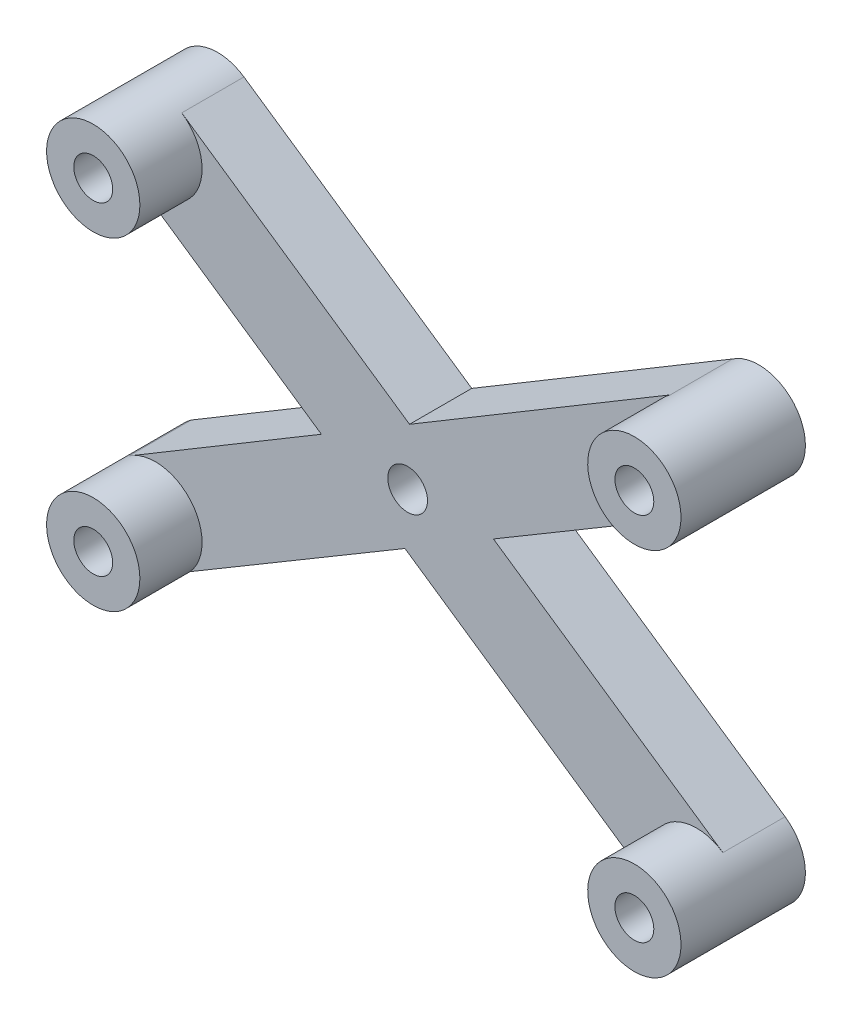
ISO-10303-21;
HEADER;
FILE_DESCRIPTION(('STEP AP214'),'2;1');
FILE_NAME('part.step','',(''),(''),'','','');
FILE_SCHEMA(('AUTOMOTIVE_DESIGN { 1 0 10303 214 1 1 1 1 }'));
ENDSEC;
DATA;
#1=APPLICATION_CONTEXT('core data for automotive mechanical design processes');
#2=APPLICATION_PROTOCOL_DEFINITION('international standard','automotive_design',2000,#1);
#3=PRODUCT_CONTEXT('',#1,'mechanical');
#4=PRODUCT('Part','Part','',(#3));
#5=PRODUCT_RELATED_PRODUCT_CATEGORY('part','',(#4));
#6=PRODUCT_DEFINITION_FORMATION('','',#4);
#7=PRODUCT_DEFINITION_CONTEXT('part definition',#1,'design');
#8=PRODUCT_DEFINITION('design','',#6,#7);
#9=PRODUCT_DEFINITION_SHAPE('','',#8);
#10=(LENGTH_UNIT() NAMED_UNIT(*) SI_UNIT(.MILLI.,.METRE.));
#11=(NAMED_UNIT(*) PLANE_ANGLE_UNIT() SI_UNIT($,.RADIAN.));
#12=(NAMED_UNIT(*) SI_UNIT($,.STERADIAN.) SOLID_ANGLE_UNIT());
#13=UNCERTAINTY_MEASURE_WITH_UNIT(LENGTH_MEASURE(1.E-05),#10,'distance_accuracy_value','');
#14=(GEOMETRIC_REPRESENTATION_CONTEXT(3) GLOBAL_UNCERTAINTY_ASSIGNED_CONTEXT((#13)) GLOBAL_UNIT_ASSIGNED_CONTEXT((#10,
#11,#12)) REPRESENTATION_CONTEXT('',''));
#15=CARTESIAN_POINT('',(0.,0.,0.));
#16=DIRECTION('',(0.,0.,1.));
#17=DIRECTION('',(1.,0.,0.));
#18=AXIS2_PLACEMENT_3D('',#15,#16,#17);
#19=CARTESIAN_POINT('',(21.0892044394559,30.8363157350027,4.));
#20=DIRECTION('',(0.564513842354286,0.825423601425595,0.));
#21=DIRECTION('',(-0.825423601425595,0.564513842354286,0.));
#22=AXIS2_PLACEMENT_3D('',#19,#20,#21);
#23=PLANE('',#22);
#24=DIRECTION('',(0.825423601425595,-0.564513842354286,0.));
#25=VECTOR('',#24,1.);
#26=CARTESIAN_POINT('',(21.0892044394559,30.8363157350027,0.));
#27=LINE('',#26,#25);
#28=CARTESIAN_POINT('',(2.52279479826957,43.5340326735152,0.));
#29=VERTEX_POINT('',#28);
#30=CARTESIAN_POINT('',(17.1727650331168,33.5148001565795,0.));
#31=VERTEX_POINT('',#30);
#32=EDGE_CURVE('E167',#29,#31,#27,.T.);
#33=ORIENTED_EDGE('',*,*,#32,.F.);
#34=DIRECTION('',(0.,0.,-1.));
#35=VECTOR('',#34,1.);
#36=CARTESIAN_POINT('',(2.52279479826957,43.5340326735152,4.));
#37=LINE('',#36,#35);
#38=CARTESIAN_POINT('',(2.52279479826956,43.5340326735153,4.));
#39=VERTEX_POINT('',#38);
#40=EDGE_CURVE('E219',#39,#29,#37,.T.);
#41=ORIENTED_EDGE('',*,*,#40,.F.);
#42=DIRECTION('',(0.825423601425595,-0.564513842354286,0.));
#43=VECTOR('',#42,1.);
#44=CARTESIAN_POINT('',(21.0892044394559,30.8363157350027,4.));
#45=LINE('',#44,#43);
#46=CARTESIAN_POINT('',(17.1727650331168,33.5148001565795,4.));
#47=VERTEX_POINT('',#46);
#48=EDGE_CURVE('E201',#39,#47,#45,.T.);
#49=ORIENTED_EDGE('',*,*,#48,.T.);
#50=DIRECTION('',(0.,0.,-1.));
#51=VECTOR('',#50,1.);
#52=CARTESIAN_POINT('',(17.1727650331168,33.5148001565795,4.));
#53=LINE('',#52,#51);
#54=EDGE_CURVE('E62',#47,#31,#53,.T.);
#55=ORIENTED_EDGE('',*,*,#54,.T.);
#56=EDGE_LOOP('',(#33,#41,#49,#55));
#57=FACE_BOUND('',#56,.T.);
#58=ADVANCED_FACE('F35',(#57),#23,.T.);
#59=CARTESIAN_POINT('',(0.829253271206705,41.0577618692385,4.));
#60=DIRECTION('',(0.,0.,-1.));
#61=DIRECTION('',(-1.,0.,0.));
#62=AXIS2_PLACEMENT_3D('',#59,#60,#61);
#63=CYLINDRICAL_SURFACE('',#62,3.);
#64=CARTESIAN_POINT('',(0.829253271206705,41.0577618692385,0.));
#65=DIRECTION('',(0.,0.,1.));
#66=DIRECTION('',(1.,0.,0.));
#67=AXIS2_PLACEMENT_3D('',#64,#65,#66);
#68=CIRCLE('',#67,3.);
#69=CARTESIAN_POINT('',(-0.864288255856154,38.5814910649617,0.));
#70=VERTEX_POINT('',#69);
#71=EDGE_CURVE('E169',#29,#70,#68,.T.);
#72=ORIENTED_EDGE('',*,*,#71,.T.);
#73=DIRECTION('',(0.,0.,-1.));
#74=VECTOR('',#73,1.);
#75=CARTESIAN_POINT('',(-0.864288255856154,38.5814910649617,4.));
#76=LINE('',#75,#74);
#77=CARTESIAN_POINT('',(-0.864288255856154,38.5814910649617,4.));
#78=VERTEX_POINT('',#77);
#79=EDGE_CURVE('E216',#78,#70,#76,.T.);
#80=ORIENTED_EDGE('',*,*,#79,.F.);
#81=CARTESIAN_POINT('',(0.829253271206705,41.0577618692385,4.));
#82=DIRECTION('',(0.,0.,1.));
#83=DIRECTION('',(1.,0.,0.));
#84=AXIS2_PLACEMENT_3D('',#81,#82,#83);
#85=CIRCLE('',#84,3.);
#86=EDGE_CURVE('E113',#78,#39,#85,.T.);
#87=ORIENTED_EDGE('',*,*,#86,.T.);
#88=ORIENTED_EDGE('',*,*,#40,.T.);
#89=EDGE_LOOP('',(#72,#80,#87,#88));
#90=FACE_BOUND('',#89,.T.);
#91=CARTESIAN_POINT('',(0.829253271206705,41.0577618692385,8.));
#92=DIRECTION('',(0.,0.,1.));
#93=DIRECTION('',(1.,0.,0.));
#94=AXIS2_PLACEMENT_3D('',#91,#92,#93);
#95=CIRCLE('',#94,3.);
#96=CARTESIAN_POINT('',(3.8292532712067,41.0577618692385,8.));
#97=VERTEX_POINT('',#96);
#98=EDGE_CURVE('E170',#97,#97,#95,.T.);
#99=ORIENTED_EDGE('',*,*,#98,.F.);
#100=EDGE_LOOP('',(#99));
#101=FACE_BOUND('',#100,.T.);
#102=ADVANCED_FACE('F252',(#90,#101),#63,.T.);
#103=CARTESIAN_POINT('',(17.7021213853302,25.8837741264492,4.));
#104=DIRECTION('',(0.564513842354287,0.825423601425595,0.));
#105=DIRECTION('',(-0.825423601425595,0.564513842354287,0.));
#106=AXIS2_PLACEMENT_3D('',#103,#104,#105);
#107=PLANE('',#106);
#108=DIRECTION('',(0.825423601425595,-0.564513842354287,0.));
#109=VECTOR('',#108,1.);
#110=CARTESIAN_POINT('',(17.7021213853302,25.8837741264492,0.));
#111=LINE('',#110,#109);
#112=CARTESIAN_POINT('',(11.5009931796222,30.1247756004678,0.));
#113=VERTEX_POINT('',#112);
#114=EDGE_CURVE('E172',#70,#113,#111,.T.);
#115=ORIENTED_EDGE('',*,*,#114,.T.);
#116=DIRECTION('',(0.,0.,-1.));
#117=VECTOR('',#116,1.);
#118=CARTESIAN_POINT('',(11.5009931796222,30.1247756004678,4.));
#119=LINE('',#118,#117);
#120=CARTESIAN_POINT('',(11.5009931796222,30.1247756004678,4.));
#121=VERTEX_POINT('',#120);
#122=EDGE_CURVE('E214',#121,#113,#119,.T.);
#123=ORIENTED_EDGE('',*,*,#122,.F.);
#124=DIRECTION('',(0.825423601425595,-0.564513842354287,0.));
#125=VECTOR('',#124,1.);
#126=CARTESIAN_POINT('',(17.7021213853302,25.8837741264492,4.));
#127=LINE('',#126,#125);
#128=EDGE_CURVE('E273',#78,#121,#127,.T.);
#129=ORIENTED_EDGE('',*,*,#128,.F.);
#130=ORIENTED_EDGE('',*,*,#79,.T.);
#131=EDGE_LOOP('',(#115,#123,#129,#130));
#132=FACE_BOUND('',#131,.T.);
#133=ADVANCED_FACE('F248',(#132),#107,.F.);
#134=CARTESIAN_POINT('',(-10.2390537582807,17.1307245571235,4.));
#135=DIRECTION('',(-0.513044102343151,0.858362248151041,0.));
#136=DIRECTION('',(-0.858362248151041,-0.513044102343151,0.));
#137=AXIS2_PLACEMENT_3D('',#134,#135,#136);
#138=PLANE('',#137);
#139=DIRECTION('',(0.858362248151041,0.513044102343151,0.));
#140=VECTOR('',#139,1.);
#141=CARTESIAN_POINT('',(-10.2390537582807,17.1307245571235,0.));
#142=LINE('',#141,#140);
#143=CARTESIAN_POINT('',(-0.864288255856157,22.7340326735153,0.));
#144=VERTEX_POINT('',#143);
#145=EDGE_CURVE('E175',#144,#113,#142,.T.);
#146=ORIENTED_EDGE('',*,*,#145,.F.);
#147=DIRECTION('',(0.,0.,-1.));
#148=VECTOR('',#147,1.);
#149=CARTESIAN_POINT('',(-0.864288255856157,22.7340326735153,4.));
#150=LINE('',#149,#148);
#151=CARTESIAN_POINT('',(-0.864288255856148,22.7340326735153,4.));
#152=VERTEX_POINT('',#151);
#153=EDGE_CURVE('E213',#152,#144,#150,.T.);
#154=ORIENTED_EDGE('',*,*,#153,.F.);
#155=CARTESIAN_POINT('',(-0.864288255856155,22.7340326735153,4.));
#156=DIRECTION('',(0.858362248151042,0.51304410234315,0.));
#157=VECTOR('',#156,1.);
#158=LINE('',#155,#157);
#159=CARTESIAN_POINT('',(-0.549722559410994,22.9220489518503,4.));
#160=VERTEX_POINT('',#159);
#161=EDGE_CURVE('E231',#152,#160,#158,.T.);
#162=ORIENTED_EDGE('',*,*,#161,.T.);
#163=DIRECTION('',(0.858362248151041,0.513044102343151,0.));
#164=VECTOR('',#163,1.);
#165=CARTESIAN_POINT('',(-10.2390537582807,17.1307245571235,4.));
#166=LINE('',#165,#164);
#167=EDGE_CURVE('E274',#160,#121,#166,.T.);
#168=ORIENTED_EDGE('',*,*,#167,.T.);
#169=ORIENTED_EDGE('',*,*,#122,.T.);
#170=EDGE_LOOP('',(#146,#154,#162,#168,#169));
#171=FACE_BOUND('',#170,.T.);
#172=ADVANCED_FACE('F237',(#171),#138,.T.);
#173=CARTESIAN_POINT('',(0.829253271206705,20.2577618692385,4.));
#174=DIRECTION('',(0.,0.,-1.));
#175=DIRECTION('',(-1.,0.,0.));
#176=AXIS2_PLACEMENT_3D('',#173,#174,#175);
#177=CYLINDRICAL_SURFACE('',#176,3.);
#178=CARTESIAN_POINT('',(0.829253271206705,20.2577618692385,0.));
#179=DIRECTION('',(0.,0.,1.));
#180=DIRECTION('',(1.,0.,0.));
#181=AXIS2_PLACEMENT_3D('',#178,#179,#180);
#182=CIRCLE('',#181,3.);
#183=CARTESIAN_POINT('',(3.05627399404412,18.2476925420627,0.));
#184=VERTEX_POINT('',#183);
#185=EDGE_CURVE('E178',#144,#184,#182,.T.);
#186=ORIENTED_EDGE('',*,*,#185,.T.);
#187=DIRECTION('',(0.,0.,-1.));
#188=VECTOR('',#187,1.);
#189=CARTESIAN_POINT('',(3.05627399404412,18.2476925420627,4.));
#190=LINE('',#189,#188);
#191=CARTESIAN_POINT('',(3.05627399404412,18.2476925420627,4.));
#192=VERTEX_POINT('',#191);
#193=EDGE_CURVE('E211',#192,#184,#190,.T.);
#194=ORIENTED_EDGE('',*,*,#193,.F.);
#195=CARTESIAN_POINT('',(0.829253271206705,20.2577618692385,4.));
#196=DIRECTION('',(0.,0.,1.));
#197=DIRECTION('',(1.,0.,0.));
#198=AXIS2_PLACEMENT_3D('',#195,#196,#197);
#199=CIRCLE('',#198,3.);
#200=EDGE_CURVE('E224',#160,#192,#199,.F.);
#201=ORIENTED_EDGE('',*,*,#200,.F.);
#202=ORIENTED_EDGE('',*,*,#161,.F.);
#203=ORIENTED_EDGE('',*,*,#153,.T.);
#204=EDGE_LOOP('',(#186,#194,#201,#202,#203));
#205=FACE_BOUND('',#204,.T.);
#206=CARTESIAN_POINT('',(0.829253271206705,20.2577618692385,8.));
#207=DIRECTION('',(0.,0.,1.));
#208=DIRECTION('',(1.,0.,0.));
#209=AXIS2_PLACEMENT_3D('',#206,#207,#208);
#210=CIRCLE('',#209,3.);
#211=CARTESIAN_POINT('',(3.82925327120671,20.2577618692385,8.));
#212=VERTEX_POINT('',#211);
#213=EDGE_CURVE('E354',#212,#212,#210,.T.);
#214=ORIENTED_EDGE('',*,*,#213,.F.);
#215=EDGE_LOOP('',(#214));
#216=FACE_BOUND('',#215,.T.);
#217=ADVANCED_FACE('F247',(#205,#216),#177,.T.);
#218=CARTESIAN_POINT('',(-7.21236056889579,12.1542712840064,4.));
#219=DIRECTION('',(0.510317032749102,-0.859986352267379,0.));
#220=DIRECTION('',(0.859986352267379,0.510317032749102,0.));
#221=AXIS2_PLACEMENT_3D('',#218,#219,#220);
#222=PLANE('',#221);
#223=DIRECTION('',(-0.859986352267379,-0.510317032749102,0.));
#224=VECTOR('',#223,1.);
#225=CARTESIAN_POINT('',(-7.21236056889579,12.1542712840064,0.));
#226=LINE('',#225,#224);
#227=CARTESIAN_POINT('',(16.8763359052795,26.4485354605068,0.));
#228=VERTEX_POINT('',#227);
#229=EDGE_CURVE('E181',#228,#184,#226,.T.);
#230=ORIENTED_EDGE('',*,*,#229,.F.);
#231=DIRECTION('',(0.,0.,-1.));
#232=VECTOR('',#231,1.);
#233=CARTESIAN_POINT('',(16.8763359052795,26.4485354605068,4.));
#234=LINE('',#233,#232);
#235=CARTESIAN_POINT('',(16.8763359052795,26.4485354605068,4.));
#236=VERTEX_POINT('',#235);
#237=EDGE_CURVE('E209',#236,#228,#234,.T.);
#238=ORIENTED_EDGE('',*,*,#237,.F.);
#239=DIRECTION('',(-0.859986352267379,-0.510317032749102,0.));
#240=VECTOR('',#239,1.);
#241=CARTESIAN_POINT('',(-7.21236056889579,12.1542712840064,4.));
#242=LINE('',#241,#240);
#243=EDGE_CURVE('E158',#236,#192,#242,.T.);
#244=ORIENTED_EDGE('',*,*,#243,.T.);
#245=ORIENTED_EDGE('',*,*,#193,.T.);
#246=EDGE_LOOP('',(#230,#238,#244,#245));
#247=FACE_BOUND('',#246,.T.);
#248=ADVANCED_FACE('F324',(#247),#222,.T.);
#249=CARTESIAN_POINT('',(17.7021213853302,25.8837741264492,4.));
#250=DIRECTION('',(0.564513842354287,0.825423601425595,0.));
#251=DIRECTION('',(-0.825423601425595,0.564513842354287,0.));
#252=AXIS2_PLACEMENT_3D('',#249,#250,#251);
#253=PLANE('',#252);
#254=DIRECTION('',(0.825423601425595,-0.564513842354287,0.));
#255=VECTOR('',#254,1.);
#256=CARTESIAN_POINT('',(17.7021213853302,25.8837741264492,0.));
#257=LINE('',#256,#255);
#258=CARTESIAN_POINT('',(33.9357117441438,14.7814910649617,0.));
#259=VERTEX_POINT('',#258);
#260=EDGE_CURVE('E184',#228,#259,#257,.T.);
#261=ORIENTED_EDGE('',*,*,#260,.T.);
#262=DIRECTION('',(0.,0.,-1.));
#263=VECTOR('',#262,1.);
#264=CARTESIAN_POINT('',(33.9357117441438,14.7814910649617,4.));
#265=LINE('',#264,#263);
#266=CARTESIAN_POINT('',(33.9357117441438,14.7814910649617,4.));
#267=VERTEX_POINT('',#266);
#268=EDGE_CURVE('E206',#267,#259,#265,.T.);
#269=ORIENTED_EDGE('',*,*,#268,.F.);
#270=DIRECTION('',(0.825423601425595,-0.564513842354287,0.));
#271=VECTOR('',#270,1.);
#272=CARTESIAN_POINT('',(17.7021213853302,25.8837741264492,4.));
#273=LINE('',#272,#271);
#274=EDGE_CURVE('E156',#236,#267,#273,.T.);
#275=ORIENTED_EDGE('',*,*,#274,.F.);
#276=ORIENTED_EDGE('',*,*,#237,.T.);
#277=EDGE_LOOP('',(#261,#269,#275,#276));
#278=FACE_BOUND('',#277,.T.);
#279=ADVANCED_FACE('F321',(#278),#253,.F.);
#280=CARTESIAN_POINT('',(35.6292532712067,17.2577618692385,4.));
#281=DIRECTION('',(0.,0.,-1.));
#282=DIRECTION('',(-1.,0.,0.));
#283=AXIS2_PLACEMENT_3D('',#280,#281,#282);
#284=CYLINDRICAL_SURFACE('',#283,3.);
#285=CARTESIAN_POINT('',(35.6292532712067,17.2577618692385,0.));
#286=DIRECTION('',(0.,0.,1.));
#287=DIRECTION('',(1.,0.,0.));
#288=AXIS2_PLACEMENT_3D('',#285,#286,#287);
#289=CIRCLE('',#288,3.);
#290=CARTESIAN_POINT('',(37.3227947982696,19.7340326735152,0.));
#291=VERTEX_POINT('',#290);
#292=EDGE_CURVE('E186',#259,#291,#289,.T.);
#293=ORIENTED_EDGE('',*,*,#292,.T.);
#294=DIRECTION('',(0.,0.,-1.));
#295=VECTOR('',#294,1.);
#296=CARTESIAN_POINT('',(37.3227947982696,19.7340326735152,4.));
#297=LINE('',#296,#295);
#298=CARTESIAN_POINT('',(37.3227947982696,19.7340326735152,4.));
#299=VERTEX_POINT('',#298);
#300=EDGE_CURVE('E148',#299,#291,#297,.T.);
#301=ORIENTED_EDGE('',*,*,#300,.F.);
#302=CARTESIAN_POINT('',(35.6292532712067,17.2577618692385,4.));
#303=DIRECTION('',(0.,0.,1.));
#304=DIRECTION('',(1.,0.,0.));
#305=AXIS2_PLACEMENT_3D('',#302,#303,#304);
#306=CIRCLE('',#305,3.);
#307=EDGE_CURVE('E155',#299,#267,#306,.T.);
#308=ORIENTED_EDGE('',*,*,#307,.T.);
#309=ORIENTED_EDGE('',*,*,#268,.T.);
#310=EDGE_LOOP('',(#293,#301,#308,#309));
#311=FACE_BOUND('',#310,.T.);
#312=CARTESIAN_POINT('',(35.6292532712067,17.2577618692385,8.));
#313=DIRECTION('',(0.,0.,1.));
#314=DIRECTION('',(1.,0.,0.));
#315=AXIS2_PLACEMENT_3D('',#312,#313,#314);
#316=CIRCLE('',#315,3.);
#317=CARTESIAN_POINT('',(38.6292532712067,17.2577618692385,8.));
#318=VERTEX_POINT('',#317);
#319=EDGE_CURVE('E342',#318,#318,#316,.T.);
#320=ORIENTED_EDGE('',*,*,#319,.F.);
#321=EDGE_LOOP('',(#320));
#322=FACE_BOUND('',#321,.T.);
#323=ADVANCED_FACE('F318',(#311,#322),#284,.T.);
#324=CARTESIAN_POINT('',(21.0892044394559,30.8363157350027,4.));
#325=DIRECTION('',(0.564513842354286,0.825423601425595,0.));
#326=DIRECTION('',(-0.825423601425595,0.564513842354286,0.));
#327=AXIS2_PLACEMENT_3D('',#324,#325,#326);
#328=PLANE('',#327);
#329=DIRECTION('',(0.825423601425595,-0.564513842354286,0.));
#330=VECTOR('',#329,1.);
#331=CARTESIAN_POINT('',(21.0892044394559,30.8363157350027,0.));
#332=LINE('',#331,#330);
#333=CARTESIAN_POINT('',(22.5672007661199,29.8255021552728,0.));
#334=VERTEX_POINT('',#333);
#335=EDGE_CURVE('E146',#334,#291,#332,.T.);
#336=ORIENTED_EDGE('',*,*,#335,.F.);
#337=DIRECTION('',(0.,0.,-1.));
#338=VECTOR('',#337,1.);
#339=CARTESIAN_POINT('',(22.5672007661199,29.8255021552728,4.));
#340=LINE('',#339,#338);
#341=CARTESIAN_POINT('',(22.5672007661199,29.8255021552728,4.));
#342=VERTEX_POINT('',#341);
#343=EDGE_CURVE('E132',#342,#334,#340,.T.);
#344=ORIENTED_EDGE('',*,*,#343,.F.);
#345=DIRECTION('',(0.825423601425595,-0.564513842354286,0.));
#346=VECTOR('',#345,1.);
#347=CARTESIAN_POINT('',(21.0892044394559,30.8363157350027,4.));
#348=LINE('',#347,#346);
#349=EDGE_CURVE('E138',#342,#299,#348,.T.);
#350=ORIENTED_EDGE('',*,*,#349,.T.);
#351=ORIENTED_EDGE('',*,*,#300,.T.);
#352=EDGE_LOOP('',(#336,#344,#350,#351));
#353=FACE_BOUND('',#352,.T.);
#354=ADVANCED_FACE('F142',(#353),#328,.T.);
#355=CARTESIAN_POINT('',(-7.21236056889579,12.1542712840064,4.));
#356=DIRECTION('',(0.510317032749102,-0.859986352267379,0.));
#357=DIRECTION('',(0.859986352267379,0.510317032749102,0.));
#358=AXIS2_PLACEMENT_3D('',#355,#356,#357);
#359=PLANE('',#358);
#360=DIRECTION('',(-0.859986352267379,-0.510317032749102,0.));
#361=VECTOR('',#360,1.);
#362=CARTESIAN_POINT('',(-7.21236056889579,12.1542712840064,0.));
#363=LINE('',#362,#361);
#364=CARTESIAN_POINT('',(37.3227947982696,38.5814910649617,0.));
#365=VERTEX_POINT('',#364);
#366=EDGE_CURVE('E190',#365,#334,#363,.T.);
#367=ORIENTED_EDGE('',*,*,#366,.F.);
#368=DIRECTION('',(0.,0.,-1.));
#369=VECTOR('',#368,1.);
#370=CARTESIAN_POINT('',(37.3227947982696,38.5814910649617,4.));
#371=LINE('',#370,#369);
#372=CARTESIAN_POINT('',(37.3227947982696,38.5814910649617,4.));
#373=VERTEX_POINT('',#372);
#374=EDGE_CURVE('E149',#373,#365,#371,.T.);
#375=ORIENTED_EDGE('',*,*,#374,.F.);
#376=CARTESIAN_POINT('',(37.3227947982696,38.5814910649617,4.));
#377=DIRECTION('',(-0.859986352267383,-0.510317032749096,0.));
#378=VECTOR('',#377,1.);
#379=LINE('',#376,#378);
#380=CARTESIAN_POINT('',(36.9912882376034,38.3847746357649,4.));
#381=VERTEX_POINT('',#380);
#382=EDGE_CURVE('E135',#373,#381,#379,.T.);
#383=ORIENTED_EDGE('',*,*,#382,.T.);
#384=DIRECTION('',(-0.859986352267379,-0.510317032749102,0.));
#385=VECTOR('',#384,1.);
#386=CARTESIAN_POINT('',(-7.21236056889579,12.1542712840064,4.));
#387=LINE('',#386,#385);
#388=EDGE_CURVE('E53',#381,#342,#387,.T.);
#389=ORIENTED_EDGE('',*,*,#388,.T.);
#390=ORIENTED_EDGE('',*,*,#343,.T.);
#391=EDGE_LOOP('',(#367,#375,#383,#389,#390));
#392=FACE_BOUND('',#391,.T.);
#393=ADVANCED_FACE('F131',(#392),#359,.T.);
#394=CARTESIAN_POINT('',(35.6292532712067,41.0577618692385,4.));
#395=DIRECTION('',(0.,0.,-1.));
#396=DIRECTION('',(-1.,0.,0.));
#397=AXIS2_PLACEMENT_3D('',#394,#395,#396);
#398=CYLINDRICAL_SURFACE('',#397,3.);
#399=CARTESIAN_POINT('',(35.6292532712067,41.0577618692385,0.));
#400=DIRECTION('',(0.,0.,1.));
#401=DIRECTION('',(1.,0.,0.));
#402=AXIS2_PLACEMENT_3D('',#399,#400,#401);
#403=CIRCLE('',#402,3.);
#404=CARTESIAN_POINT('',(33.9357117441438,43.5340326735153,0.));
#405=VERTEX_POINT('',#404);
#406=EDGE_CURVE('E192',#365,#405,#403,.T.);
#407=ORIENTED_EDGE('',*,*,#406,.T.);
#408=DIRECTION('',(0.,0.,-1.));
#409=VECTOR('',#408,1.);
#410=CARTESIAN_POINT('',(33.9357117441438,43.5340326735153,4.));
#411=LINE('',#410,#409);
#412=CARTESIAN_POINT('',(33.9357117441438,43.5340326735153,4.));
#413=VERTEX_POINT('',#412);
#414=EDGE_CURVE('E203',#413,#405,#411,.T.);
#415=ORIENTED_EDGE('',*,*,#414,.F.);
#416=CARTESIAN_POINT('',(35.6292532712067,41.0577618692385,4.));
#417=DIRECTION('',(0.,0.,1.));
#418=DIRECTION('',(1.,0.,0.));
#419=AXIS2_PLACEMENT_3D('',#416,#417,#418);
#420=CIRCLE('',#419,3.);
#421=EDGE_CURVE('E404',#413,#381,#420,.T.);
#422=ORIENTED_EDGE('',*,*,#421,.T.);
#423=ORIENTED_EDGE('',*,*,#382,.F.);
#424=ORIENTED_EDGE('',*,*,#374,.T.);
#425=EDGE_LOOP('',(#407,#415,#422,#423,#424));
#426=FACE_BOUND('',#425,.T.);
#427=CARTESIAN_POINT('',(35.6292532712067,41.0577618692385,8.));
#428=DIRECTION('',(0.,0.,1.));
#429=DIRECTION('',(1.,0.,0.));
#430=AXIS2_PLACEMENT_3D('',#427,#428,#429);
#431=CIRCLE('',#430,3.);
#432=CARTESIAN_POINT('',(38.6292532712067,41.0577618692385,8.));
#433=VERTEX_POINT('',#432);
#434=EDGE_CURVE('E349',#433,#433,#431,.T.);
#435=ORIENTED_EDGE('',*,*,#434,.F.);
#436=EDGE_LOOP('',(#435));
#437=FACE_BOUND('',#436,.T.);
#438=ADVANCED_FACE('F313',(#426,#437),#398,.T.);
#439=CARTESIAN_POINT('',(-10.2390537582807,17.1307245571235,4.));
#440=DIRECTION('',(-0.513044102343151,0.858362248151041,0.));
#441=DIRECTION('',(-0.858362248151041,-0.513044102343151,0.));
#442=AXIS2_PLACEMENT_3D('',#439,#440,#441);
#443=PLANE('',#442);
#444=DIRECTION('',(0.858362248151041,0.513044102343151,0.));
#445=VECTOR('',#444,1.);
#446=CARTESIAN_POINT('',(-10.2390537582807,17.1307245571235,0.));
#447=LINE('',#446,#445);
#448=EDGE_CURVE('E195',#31,#405,#447,.T.);
#449=ORIENTED_EDGE('',*,*,#448,.F.);
#450=ORIENTED_EDGE('',*,*,#54,.F.);
#451=DIRECTION('',(0.858362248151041,0.513044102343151,0.));
#452=VECTOR('',#451,1.);
#453=CARTESIAN_POINT('',(-10.2390537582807,17.1307245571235,4.));
#454=LINE('',#453,#452);
#455=EDGE_CURVE('E162',#47,#413,#454,.T.);
#456=ORIENTED_EDGE('',*,*,#455,.T.);
#457=ORIENTED_EDGE('',*,*,#414,.T.);
#458=EDGE_LOOP('',(#449,#450,#456,#457));
#459=FACE_BOUND('',#458,.T.);
#460=ADVANCED_FACE('F385',(#459),#443,.T.);
#461=CARTESIAN_POINT('',(17.0489085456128,29.828436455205,4.));
#462=DIRECTION('',(0.,0.,-1.));
#463=DIRECTION('',(-1.,0.,0.));
#464=AXIS2_PLACEMENT_3D('',#461,#462,#463);
#465=CYLINDRICAL_SURFACE('',#464,1.2779103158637);
#466=CARTESIAN_POINT('',(17.0489085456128,29.828436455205,4.));
#467=DIRECTION('',(0.,0.,1.));
#468=DIRECTION('',(1.,0.,0.));
#469=AXIS2_PLACEMENT_3D('',#466,#467,#468);
#470=CIRCLE('',#469,1.2779103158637);
#471=CARTESIAN_POINT('',(18.3268188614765,29.828436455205,4.));
#472=VERTEX_POINT('',#471);
#473=EDGE_CURVE('E164',#472,#472,#470,.T.);
#474=ORIENTED_EDGE('',*,*,#473,.T.);
#475=EDGE_LOOP('',(#474));
#476=FACE_BOUND('',#475,.T.);
#477=CARTESIAN_POINT('',(17.0489085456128,29.828436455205,0.));
#478=DIRECTION('',(0.,0.,1.));
#479=DIRECTION('',(1.,0.,0.));
#480=AXIS2_PLACEMENT_3D('',#477,#478,#479);
#481=CIRCLE('',#480,1.2779103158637);
#482=CARTESIAN_POINT('',(18.3268188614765,29.828436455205,0.));
#483=VERTEX_POINT('',#482);
#484=EDGE_CURVE('E198',#483,#483,#481,.T.);
#485=ORIENTED_EDGE('',*,*,#484,.F.);
#486=EDGE_LOOP('',(#485));
#487=FACE_BOUND('',#486,.T.);
#488=ADVANCED_FACE('F380',(#476,#487),#465,.F.);
#489=CARTESIAN_POINT('',(0.,0.,4.));
#490=DIRECTION('',(0.,0.,1.));
#491=DIRECTION('',(1.,0.,0.));
#492=AXIS2_PLACEMENT_3D('',#489,#490,#491);
#493=PLANE('',#492);
#494=ORIENTED_EDGE('',*,*,#388,.F.);
#495=ORIENTED_EDGE('',*,*,#421,.F.);
#496=ORIENTED_EDGE('',*,*,#455,.F.);
#497=ORIENTED_EDGE('',*,*,#48,.F.);
#498=ORIENTED_EDGE('',*,*,#86,.F.);
#499=ORIENTED_EDGE('',*,*,#128,.T.);
#500=ORIENTED_EDGE('',*,*,#167,.F.);
#501=ORIENTED_EDGE('',*,*,#200,.T.);
#502=ORIENTED_EDGE('',*,*,#243,.F.);
#503=ORIENTED_EDGE('',*,*,#274,.T.);
#504=ORIENTED_EDGE('',*,*,#307,.F.);
#505=ORIENTED_EDGE('',*,*,#349,.F.);
#506=EDGE_LOOP('',(#494,#495,#496,#497,#498,#499,#500,#501,#502,#503,#504,#505));
#507=FACE_BOUND('',#506,.T.);
#508=ORIENTED_EDGE('',*,*,#473,.F.);
#509=EDGE_LOOP('',(#508));
#510=FACE_BOUND('',#509,.T.);
#511=ADVANCED_FACE('F152',(#507,#510),#493,.T.);
#512=CARTESIAN_POINT('',(0.,0.,0.));
#513=DIRECTION('',(0.,0.,1.));
#514=DIRECTION('',(1.,0.,0.));
#515=AXIS2_PLACEMENT_3D('',#512,#513,#514);
#516=PLANE('',#515);
#517=ORIENTED_EDGE('',*,*,#32,.T.);
#518=ORIENTED_EDGE('',*,*,#448,.T.);
#519=ORIENTED_EDGE('',*,*,#406,.F.);
#520=ORIENTED_EDGE('',*,*,#366,.T.);
#521=ORIENTED_EDGE('',*,*,#335,.T.);
#522=ORIENTED_EDGE('',*,*,#292,.F.);
#523=ORIENTED_EDGE('',*,*,#260,.F.);
#524=ORIENTED_EDGE('',*,*,#229,.T.);
#525=ORIENTED_EDGE('',*,*,#185,.F.);
#526=ORIENTED_EDGE('',*,*,#145,.T.);
#527=ORIENTED_EDGE('',*,*,#114,.F.);
#528=ORIENTED_EDGE('',*,*,#71,.F.);
#529=EDGE_LOOP('',(#517,#518,#519,#520,#521,#522,#523,#524,#525,#526,#527,#528));
#530=FACE_BOUND('',#529,.T.);
#531=ORIENTED_EDGE('',*,*,#484,.T.);
#532=EDGE_LOOP('',(#531));
#533=FACE_BOUND('',#532,.T.);
#534=ADVANCED_FACE('F336',(#530,#533),#516,.F.);
#535=CARTESIAN_POINT('',(0.829253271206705,41.0577618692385,8.));
#536=DIRECTION('',(0.,0.,1.));
#537=DIRECTION('',(1.,0.,0.));
#538=AXIS2_PLACEMENT_3D('',#535,#536,#537);
#539=PLANE('',#538);
#540=ORIENTED_EDGE('',*,*,#98,.T.);
#541=EDGE_LOOP('',(#540));
#542=FACE_BOUND('',#541,.T.);
#543=CARTESIAN_POINT('',(0.829253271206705,41.0577618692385,8.));
#544=DIRECTION('',(0.,0.,1.));
#545=DIRECTION('',(1.,0.,0.));
#546=AXIS2_PLACEMENT_3D('',#543,#544,#545);
#547=CIRCLE('',#546,1.25);
#548=CARTESIAN_POINT('',(2.07925327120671,41.0577618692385,8.));
#549=VERTEX_POINT('',#548);
#550=EDGE_CURVE('E264',#549,#549,#547,.T.);
#551=ORIENTED_EDGE('',*,*,#550,.F.);
#552=EDGE_LOOP('',(#551));
#553=FACE_BOUND('',#552,.T.);
#554=ADVANCED_FACE('F365',(#542,#553),#539,.T.);
#555=CARTESIAN_POINT('',(0.829253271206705,41.0577618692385,8.));
#556=DIRECTION('',(0.,0.,-1.));
#557=DIRECTION('',(-1.,0.,0.));
#558=AXIS2_PLACEMENT_3D('',#555,#556,#557);
#559=CYLINDRICAL_SURFACE('',#558,1.25);
#560=ORIENTED_EDGE('',*,*,#550,.T.);
#561=EDGE_LOOP('',(#560));
#562=FACE_BOUND('',#561,.T.);
#563=CARTESIAN_POINT('',(0.829253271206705,41.0577618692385,4.));
#564=DIRECTION('',(0.,0.,1.));
#565=DIRECTION('',(1.,0.,0.));
#566=AXIS2_PLACEMENT_3D('',#563,#564,#565);
#567=CIRCLE('',#566,1.25);
#568=CARTESIAN_POINT('',(2.07925327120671,41.0577618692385,4.));
#569=VERTEX_POINT('',#568);
#570=EDGE_CURVE('E267',#569,#569,#567,.T.);
#571=ORIENTED_EDGE('',*,*,#570,.F.);
#572=EDGE_LOOP('',(#571));
#573=FACE_BOUND('',#572,.T.);
#574=ADVANCED_FACE('F363',(#562,#573),#559,.F.);
#575=ORIENTED_EDGE('',*,*,#570,.T.);
#576=EDGE_LOOP('',(#575));
#577=FACE_BOUND('',#576,.T.);
#578=ADVANCED_FACE('F361',(#577),#493,.T.);
#579=CARTESIAN_POINT('',(0.829253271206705,20.2577618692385,8.));
#580=DIRECTION('',(0.,0.,1.));
#581=DIRECTION('',(1.,0.,0.));
#582=AXIS2_PLACEMENT_3D('',#579,#580,#581);
#583=PLANE('',#582);
#584=ORIENTED_EDGE('',*,*,#213,.T.);
#585=EDGE_LOOP('',(#584));
#586=FACE_BOUND('',#585,.T.);
#587=CARTESIAN_POINT('',(0.829253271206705,20.2577618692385,8.));
#588=DIRECTION('',(0.,0.,1.));
#589=DIRECTION('',(1.,0.,0.));
#590=AXIS2_PLACEMENT_3D('',#587,#588,#589);
#591=CIRCLE('',#590,1.25);
#592=CARTESIAN_POINT('',(2.07925327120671,20.2577618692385,8.));
#593=VERTEX_POINT('',#592);
#594=EDGE_CURVE('E346',#593,#593,#591,.T.);
#595=ORIENTED_EDGE('',*,*,#594,.F.);
#596=EDGE_LOOP('',(#595));
#597=FACE_BOUND('',#596,.T.);
#598=ADVANCED_FACE('F372',(#586,#597),#583,.T.);
#599=CARTESIAN_POINT('',(0.829253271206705,20.2577618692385,8.));
#600=DIRECTION('',(0.,0.,-1.));
#601=DIRECTION('',(-1.,0.,0.));
#602=AXIS2_PLACEMENT_3D('',#599,#600,#601);
#603=CYLINDRICAL_SURFACE('',#602,1.25);
#604=ORIENTED_EDGE('',*,*,#594,.T.);
#605=EDGE_LOOP('',(#604));
#606=FACE_BOUND('',#605,.T.);
#607=CARTESIAN_POINT('',(0.829253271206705,20.2577618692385,4.));
#608=DIRECTION('',(0.,0.,1.));
#609=DIRECTION('',(1.,0.,0.));
#610=AXIS2_PLACEMENT_3D('',#607,#608,#609);
#611=CIRCLE('',#610,1.25);
#612=CARTESIAN_POINT('',(2.07925327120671,20.2577618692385,4.));
#613=VERTEX_POINT('',#612);
#614=EDGE_CURVE('E221',#613,#613,#611,.F.);
#615=ORIENTED_EDGE('',*,*,#614,.T.);
#616=EDGE_LOOP('',(#615));
#617=FACE_BOUND('',#616,.T.);
#618=ADVANCED_FACE('F437',(#606,#617),#603,.F.);
#619=ORIENTED_EDGE('',*,*,#614,.F.);
#620=EDGE_LOOP('',(#619));
#621=FACE_BOUND('',#620,.T.);
#622=ADVANCED_FACE('F374',(#621),#493,.T.);
#623=CARTESIAN_POINT('',(35.6292532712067,17.2577618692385,8.));
#624=DIRECTION('',(0.,0.,1.));
#625=DIRECTION('',(1.,0.,0.));
#626=AXIS2_PLACEMENT_3D('',#623,#624,#625);
#627=PLANE('',#626);
#628=ORIENTED_EDGE('',*,*,#319,.T.);
#629=EDGE_LOOP('',(#628));
#630=FACE_BOUND('',#629,.T.);
#631=CARTESIAN_POINT('',(35.6292532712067,17.2577618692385,8.));
#632=DIRECTION('',(0.,0.,1.));
#633=DIRECTION('',(1.,0.,0.));
#634=AXIS2_PLACEMENT_3D('',#631,#632,#633);
#635=CIRCLE('',#634,1.25);
#636=CARTESIAN_POINT('',(36.8792532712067,17.2577618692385,8.));
#637=VERTEX_POINT('',#636);
#638=EDGE_CURVE('E343',#637,#637,#635,.T.);
#639=ORIENTED_EDGE('',*,*,#638,.F.);
#640=EDGE_LOOP('',(#639));
#641=FACE_BOUND('',#640,.T.);
#642=ADVANCED_FACE('F433',(#630,#641),#627,.T.);
#643=CARTESIAN_POINT('',(35.6292532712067,17.2577618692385,8.));
#644=DIRECTION('',(0.,0.,-1.));
#645=DIRECTION('',(-1.,0.,0.));
#646=AXIS2_PLACEMENT_3D('',#643,#644,#645);
#647=CYLINDRICAL_SURFACE('',#646,1.25);
#648=ORIENTED_EDGE('',*,*,#638,.T.);
#649=EDGE_LOOP('',(#648));
#650=FACE_BOUND('',#649,.T.);
#651=CARTESIAN_POINT('',(35.6292532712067,17.2577618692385,4.));
#652=DIRECTION('',(0.,0.,1.));
#653=DIRECTION('',(1.,0.,0.));
#654=AXIS2_PLACEMENT_3D('',#651,#652,#653);
#655=CIRCLE('',#654,1.25);
#656=CARTESIAN_POINT('',(36.8792532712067,17.2577618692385,4.));
#657=VERTEX_POINT('',#656);
#658=EDGE_CURVE('E45',#657,#657,#655,.F.);
#659=ORIENTED_EDGE('',*,*,#658,.T.);
#660=EDGE_LOOP('',(#659));
#661=FACE_BOUND('',#660,.T.);
#662=ADVANCED_FACE('F428',(#650,#661),#647,.F.);
#663=ORIENTED_EDGE('',*,*,#658,.F.);
#664=EDGE_LOOP('',(#663));
#665=FACE_BOUND('',#664,.T.);
#666=ADVANCED_FACE('F420',(#665),#493,.T.);
#667=CARTESIAN_POINT('',(35.6292532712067,41.0577618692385,8.));
#668=DIRECTION('',(0.,0.,1.));
#669=DIRECTION('',(1.,0.,0.));
#670=AXIS2_PLACEMENT_3D('',#667,#668,#669);
#671=PLANE('',#670);
#672=ORIENTED_EDGE('',*,*,#434,.T.);
#673=EDGE_LOOP('',(#672));
#674=FACE_BOUND('',#673,.T.);
#675=CARTESIAN_POINT('',(35.6292532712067,41.0577618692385,8.));
#676=DIRECTION('',(0.,0.,1.));
#677=DIRECTION('',(1.,0.,0.));
#678=AXIS2_PLACEMENT_3D('',#675,#676,#677);
#679=CIRCLE('',#678,1.25);
#680=CARTESIAN_POINT('',(36.8792532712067,41.0577618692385,8.));
#681=VERTEX_POINT('',#680);
#682=EDGE_CURVE('E405',#681,#681,#679,.T.);
#683=ORIENTED_EDGE('',*,*,#682,.F.);
#684=EDGE_LOOP('',(#683));
#685=FACE_BOUND('',#684,.T.);
#686=ADVANCED_FACE('F418',(#674,#685),#671,.T.);
#687=CARTESIAN_POINT('',(35.6292532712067,41.0577618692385,8.));
#688=DIRECTION('',(0.,0.,-1.));
#689=DIRECTION('',(-1.,0.,0.));
#690=AXIS2_PLACEMENT_3D('',#687,#688,#689);
#691=CYLINDRICAL_SURFACE('',#690,1.25);
#692=ORIENTED_EDGE('',*,*,#682,.T.);
#693=EDGE_LOOP('',(#692));
#694=FACE_BOUND('',#693,.T.);
#695=CARTESIAN_POINT('',(35.6292532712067,41.0577618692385,4.));
#696=DIRECTION('',(0.,0.,1.));
#697=DIRECTION('',(1.,0.,0.));
#698=AXIS2_PLACEMENT_3D('',#695,#696,#697);
#699=CIRCLE('',#698,1.25);
#700=CARTESIAN_POINT('',(36.8792532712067,41.0577618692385,4.));
#701=VERTEX_POINT('',#700);
#702=EDGE_CURVE('E11',#701,#701,#699,.F.);
#703=ORIENTED_EDGE('',*,*,#702,.T.);
#704=EDGE_LOOP('',(#703));
#705=FACE_BOUND('',#704,.T.);
#706=ADVANCED_FACE('F415',(#694,#705),#691,.F.);
#707=ORIENTED_EDGE('',*,*,#702,.F.);
#708=EDGE_LOOP('',(#707));
#709=FACE_BOUND('',#708,.T.);
#710=ADVANCED_FACE('F381',(#709),#493,.T.);
#711=CLOSED_SHELL('',(#58,#102,#133,#172,#217,#248,#279,#323,#354,#393,#438,#460,#488,#511,#534,
#554,#574,#578,#598,#618,#622,#642,#662,#666,#686,#706,#710));
#712=MANIFOLD_SOLID_BREP('B2',#711);
#713=ADVANCED_BREP_SHAPE_REPRESENTATION('',(#18,#712),#14);
#714=SHAPE_DEFINITION_REPRESENTATION(#9,#713);
ENDSEC;
END-ISO-10303-21;
